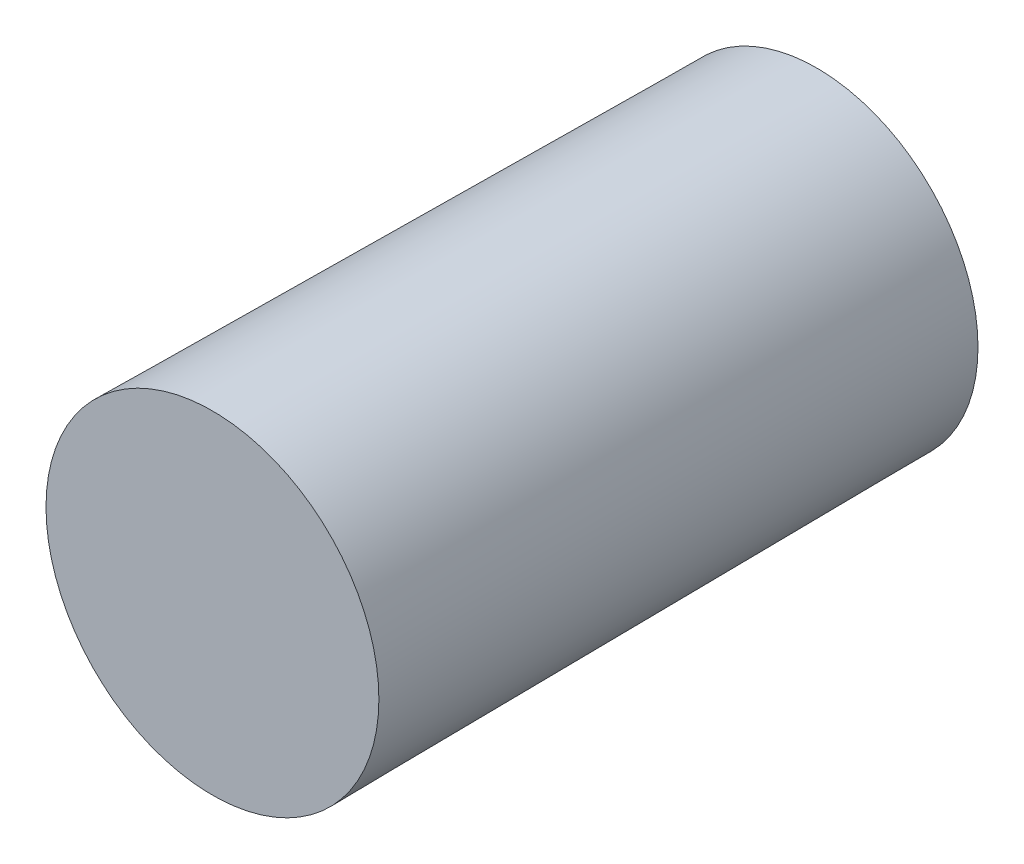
from build123d import *

# Parameters (mm, degrees)
ESQUISSE1_R      = 4
EXTRUSION1_DEPTH = 15
EXTRUSION1_DRAFT = -0.5


with BuildPart() as part:
    # Esquisse1 → Extrusion1 (with draft: the straight prism first)
    with BuildSketch(Plane.XY):
        Circle(ESQUISSE1_R)
    extrude(amount=EXTRUSION1_DEPTH)
    # Extrusion1: the draft: its side faces are tilted about the plane it starts from
    extrusion1_sides = [part.faces().sort_by_distance(p)[0] for p in [
        (-4, 0, 7.5),
    ]]
    draft(extrusion1_sides, Plane.XY, EXTRUSION1_DRAFT)


solid = part.part
